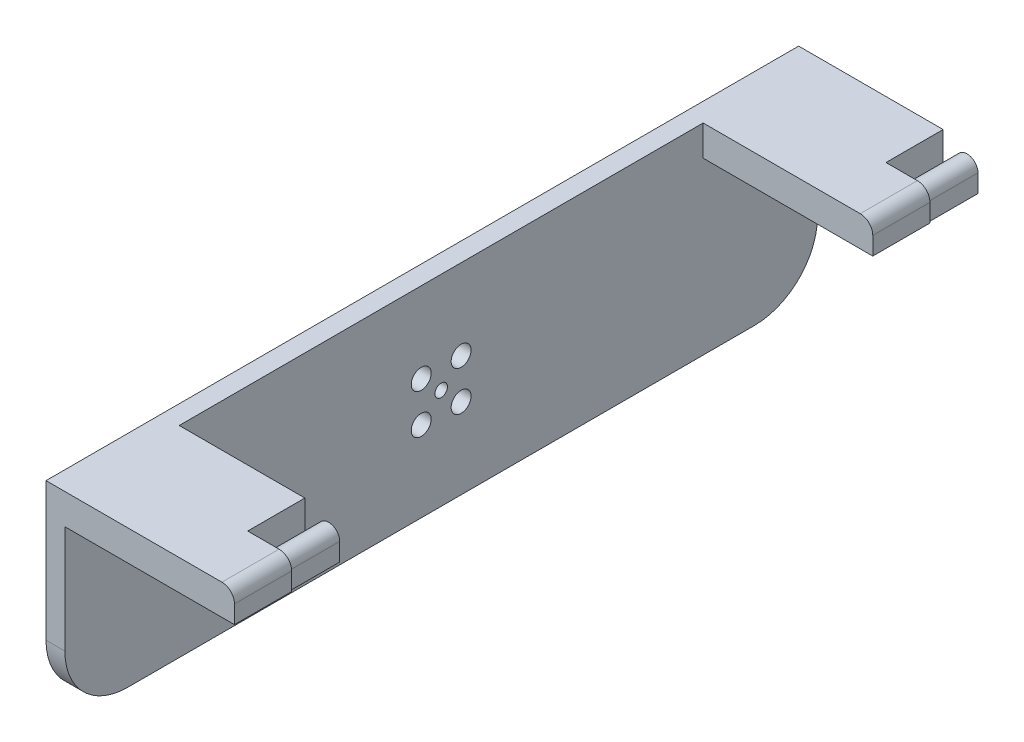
ISO-10303-21;
HEADER;
FILE_DESCRIPTION(('STEP AP214'),'2;1');
FILE_NAME('part.step','',(''),(''),'','','');
FILE_SCHEMA(('AUTOMOTIVE_DESIGN { 1 0 10303 214 1 1 1 1 }'));
ENDSEC;
DATA;
#1=APPLICATION_CONTEXT('core data for automotive mechanical design processes');
#2=APPLICATION_PROTOCOL_DEFINITION('international standard','automotive_design',2000,#1);
#3=PRODUCT_CONTEXT('',#1,'mechanical');
#4=PRODUCT('Part','Part','',(#3));
#5=PRODUCT_RELATED_PRODUCT_CATEGORY('part','',(#4));
#6=PRODUCT_DEFINITION_FORMATION('','',#4);
#7=PRODUCT_DEFINITION_CONTEXT('part definition',#1,'design');
#8=PRODUCT_DEFINITION('design','',#6,#7);
#9=PRODUCT_DEFINITION_SHAPE('','',#8);
#10=(LENGTH_UNIT() NAMED_UNIT(*) SI_UNIT(.MILLI.,.METRE.));
#11=(NAMED_UNIT(*) PLANE_ANGLE_UNIT() SI_UNIT($,.RADIAN.));
#12=(NAMED_UNIT(*) SI_UNIT($,.STERADIAN.) SOLID_ANGLE_UNIT());
#13=UNCERTAINTY_MEASURE_WITH_UNIT(LENGTH_MEASURE(1.E-05),#10,'distance_accuracy_value','');
#14=(GEOMETRIC_REPRESENTATION_CONTEXT(3) GLOBAL_UNCERTAINTY_ASSIGNED_CONTEXT((#13)) GLOBAL_UNIT_ASSIGNED_CONTEXT((#10,
#11,#12)) REPRESENTATION_CONTEXT('',''));
#15=CARTESIAN_POINT('',(0.,0.,0.));
#16=DIRECTION('',(0.,0.,1.));
#17=DIRECTION('',(1.,0.,0.));
#18=AXIS2_PLACEMENT_3D('',#15,#16,#17);
#19=CARTESIAN_POINT('',(0.,0.,-93.7));
#20=DIRECTION('',(0.,0.,1.));
#21=DIRECTION('',(1.,0.,0.));
#22=AXIS2_PLACEMENT_3D('',#19,#20,#21);
#23=PLANE('',#22);
#24=DIRECTION('',(0.,-1.,0.));
#25=VECTOR('',#24,1.);
#26=CARTESIAN_POINT('',(1.75,0.,-93.7));
#27=LINE('',#26,#25);
#28=CARTESIAN_POINT('',(1.75,0.,-93.7));
#29=VERTEX_POINT('',#28);
#30=CARTESIAN_POINT('',(1.75,-2.85,-93.7));
#31=VERTEX_POINT('',#30);
#32=EDGE_CURVE('E224',#29,#31,#27,.T.);
#33=ORIENTED_EDGE('',*,*,#32,.F.);
#34=CARTESIAN_POINT('',(0.,0.,-93.7));
#35=DIRECTION('',(0.,0.,-1.));
#36=DIRECTION('',(-1.,0.,0.));
#37=AXIS2_PLACEMENT_3D('',#34,#35,#36);
#38=CIRCLE('',#37,1.75);
#39=CARTESIAN_POINT('',(-1.75,0.,-93.7));
#40=VERTEX_POINT('',#39);
#41=EDGE_CURVE('E223',#40,#29,#38,.T.);
#42=ORIENTED_EDGE('',*,*,#41,.F.);
#43=DIRECTION('',(0.,1.,0.));
#44=VECTOR('',#43,1.);
#45=CARTESIAN_POINT('',(-1.75,-2.85,-93.7));
#46=LINE('',#45,#44);
#47=CARTESIAN_POINT('',(-1.75,-2.85,-93.7));
#48=VERTEX_POINT('',#47);
#49=EDGE_CURVE('E209',#48,#40,#46,.T.);
#50=ORIENTED_EDGE('',*,*,#49,.F.);
#51=DIRECTION('',(1.,0.,0.));
#52=VECTOR('',#51,1.);
#53=CARTESIAN_POINT('',(2.,-2.85,-93.7));
#54=LINE('',#53,#52);
#55=CARTESIAN_POINT('',(-5.,-2.85,-93.7));
#56=VERTEX_POINT('',#55);
#57=EDGE_CURVE('E222',#56,#48,#54,.T.);
#58=ORIENTED_EDGE('',*,*,#57,.F.);
#59=DIRECTION('',(0.,-1.,0.));
#60=VECTOR('',#59,1.);
#61=CARTESIAN_POINT('',(-5.,-2.85,-93.7));
#62=LINE('',#61,#60);
#63=CARTESIAN_POINT('',(-5.,2.,-93.7));
#64=VERTEX_POINT('',#63);
#65=EDGE_CURVE('E646',#64,#56,#62,.T.);
#66=ORIENTED_EDGE('',*,*,#65,.F.);
#67=DIRECTION('',(-1.,0.,0.));
#68=VECTOR('',#67,1.);
#69=CARTESIAN_POINT('',(0.,2.,-93.7));
#70=LINE('',#69,#68);
#71=CARTESIAN_POINT('',(0.,2.,-93.7));
#72=VERTEX_POINT('',#71);
#73=EDGE_CURVE('E236',#72,#64,#70,.T.);
#74=ORIENTED_EDGE('',*,*,#73,.F.);
#75=CARTESIAN_POINT('',(0.,0.,-93.7));
#76=DIRECTION('',(0.,0.,1.));
#77=DIRECTION('',(1.,0.,0.));
#78=AXIS2_PLACEMENT_3D('',#75,#76,#77);
#79=CIRCLE('',#78,2.);
#80=CARTESIAN_POINT('',(2.,0.,-93.7));
#81=VERTEX_POINT('',#80);
#82=EDGE_CURVE('E653',#81,#72,#79,.T.);
#83=ORIENTED_EDGE('',*,*,#82,.F.);
#84=DIRECTION('',(0.,1.,0.));
#85=VECTOR('',#84,1.);
#86=CARTESIAN_POINT('',(2.,0.,-93.7));
#87=LINE('',#86,#85);
#88=CARTESIAN_POINT('',(2.,-2.85,-93.7));
#89=VERTEX_POINT('',#88);
#90=EDGE_CURVE('E231',#89,#81,#87,.T.);
#91=ORIENTED_EDGE('',*,*,#90,.F.);
#92=EDGE_CURVE('E232',#31,#89,#54,.T.);
#93=ORIENTED_EDGE('',*,*,#92,.F.);
#94=EDGE_LOOP('',(#33,#42,#50,#58,#66,#74,#83,#91,#93));
#95=FACE_BOUND('',#94,.T.);
#96=ADVANCED_FACE('F29',(#95),#23,.F.);
#97=CARTESIAN_POINT('',(-25.,-30.,-102.8));
#98=DIRECTION('',(-1.,0.,0.));
#99=DIRECTION('',(0.,0.,1.));
#100=AXIS2_PLACEMENT_3D('',#97,#98,#99);
#101=PLANE('',#100);
#102=CARTESIAN_POINT('',(-25.,-17.175,-46.075));
#103=DIRECTION('',(1.,0.,0.));
#104=DIRECTION('',(0.,0.,1.));
#105=AXIS2_PLACEMENT_3D('',#102,#103,#104);
#106=CIRCLE('',#105,1.5875);
#107=CARTESIAN_POINT('',(-25.,-17.175,-44.4875));
#108=VERTEX_POINT('',#107);
#109=EDGE_CURVE('E602',#108,#108,#106,.T.);
#110=ORIENTED_EDGE('',*,*,#109,.F.);
#111=EDGE_LOOP('',(#110));
#112=FACE_BOUND('',#111,.T.);
#113=CARTESIAN_POINT('',(-25.,-17.175,-39.725));
#114=DIRECTION('',(1.,0.,0.));
#115=DIRECTION('',(0.,0.,-1.));
#116=AXIS2_PLACEMENT_3D('',#113,#114,#115);
#117=CIRCLE('',#116,1.58750000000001);
#118=CARTESIAN_POINT('',(-25.,-17.175,-41.3125));
#119=VERTEX_POINT('',#118);
#120=EDGE_CURVE('E604',#119,#119,#117,.T.);
#121=ORIENTED_EDGE('',*,*,#120,.F.);
#122=EDGE_LOOP('',(#121));
#123=FACE_BOUND('',#122,.T.);
#124=CARTESIAN_POINT('',(-25.,-10.825,-39.725));
#125=DIRECTION('',(1.,0.,0.));
#126=DIRECTION('',(0.,0.,1.));
#127=AXIS2_PLACEMENT_3D('',#124,#125,#126);
#128=CIRCLE('',#127,1.58750000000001);
#129=CARTESIAN_POINT('',(-25.,-10.825,-38.1375));
#130=VERTEX_POINT('',#129);
#131=EDGE_CURVE('E612',#130,#130,#128,.T.);
#132=ORIENTED_EDGE('',*,*,#131,.F.);
#133=EDGE_LOOP('',(#132));
#134=FACE_BOUND('',#133,.T.);
#135=CARTESIAN_POINT('',(-25.,-10.825,-46.075));
#136=DIRECTION('',(1.,0.,0.));
#137=DIRECTION('',(0.,0.,-1.));
#138=AXIS2_PLACEMENT_3D('',#135,#136,#137);
#139=CIRCLE('',#138,1.5875);
#140=CARTESIAN_POINT('',(-25.,-10.825,-47.6625));
#141=VERTEX_POINT('',#140);
#142=EDGE_CURVE('E618',#141,#141,#139,.T.);
#143=ORIENTED_EDGE('',*,*,#142,.F.);
#144=EDGE_LOOP('',(#143));
#145=FACE_BOUND('',#144,.T.);
#146=CARTESIAN_POINT('',(-25.,-14.,-42.9));
#147=DIRECTION('',(-1.,0.,0.));
#148=DIRECTION('',(0.,0.,1.));
#149=AXIS2_PLACEMENT_3D('',#146,#147,#148);
#150=CIRCLE('',#149,0.999999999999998);
#151=CARTESIAN_POINT('',(-25.,-14.,-41.9));
#152=VERTEX_POINT('',#151);
#153=EDGE_CURVE('E263',#152,#152,#150,.T.);
#154=ORIENTED_EDGE('',*,*,#153,.T.);
#155=EDGE_LOOP('',(#154));
#156=FACE_BOUND('',#155,.T.);
#157=DIRECTION('',(0.,0.,1.));
#158=VECTOR('',#157,1.);
#159=CARTESIAN_POINT('',(-25.,-30.,-102.8));
#160=LINE('',#159,#158);
#161=CARTESIAN_POINT('',(-25.,-30.,-92.8));
#162=VERTEX_POINT('',#161);
#163=CARTESIAN_POINT('',(-25.,-30.,7.00000000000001));
#164=VERTEX_POINT('',#163);
#165=EDGE_CURVE('E271',#162,#164,#160,.T.);
#166=ORIENTED_EDGE('',*,*,#165,.F.);
#167=CARTESIAN_POINT('',(-25.,-20.,-92.8));
#168=DIRECTION('',(-1.,0.,0.));
#169=DIRECTION('',(0.,0.,1.));
#170=AXIS2_PLACEMENT_3D('',#167,#168,#169);
#171=CIRCLE('',#170,10.);
#172=CARTESIAN_POINT('',(-25.,-20.,-102.8));
#173=VERTEX_POINT('',#172);
#174=EDGE_CURVE('E287',#162,#173,#171,.F.);
#175=ORIENTED_EDGE('',*,*,#174,.T.);
#176=DIRECTION('',(0.,-1.,0.));
#177=VECTOR('',#176,1.);
#178=CARTESIAN_POINT('',(-25.,2.,-102.8));
#179=LINE('',#178,#177);
#180=CARTESIAN_POINT('',(-25.,-2.85,-102.8));
#181=VERTEX_POINT('',#180);
#182=EDGE_CURVE('E269',#181,#173,#179,.T.);
#183=ORIENTED_EDGE('',*,*,#182,.F.);
#184=DIRECTION('',(0.,0.,-1.));
#185=VECTOR('',#184,1.);
#186=CARTESIAN_POINT('',(-25.,-2.85,-84.6));
#187=LINE('',#186,#185);
#188=CARTESIAN_POINT('',(-25.,-2.85000000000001,-84.6));
#189=VERTEX_POINT('',#188);
#190=EDGE_CURVE('E258',#189,#181,#187,.T.);
#191=ORIENTED_EDGE('',*,*,#190,.F.);
#192=DIRECTION('',(0.,-1.,0.));
#193=VECTOR('',#192,1.);
#194=CARTESIAN_POINT('',(-25.,2.,-84.6));
#195=LINE('',#194,#193);
#196=CARTESIAN_POINT('',(-25.,2.,-84.6));
#197=VERTEX_POINT('',#196);
#198=EDGE_CURVE('E245',#197,#189,#195,.T.);
#199=ORIENTED_EDGE('',*,*,#198,.F.);
#200=DIRECTION('',(0.,0.,-1.));
#201=VECTOR('',#200,1.);
#202=CARTESIAN_POINT('',(-25.,2.,-102.8));
#203=LINE('',#202,#201);
#204=CARTESIAN_POINT('',(-25.,2.,-1.20000000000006));
#205=VERTEX_POINT('',#204);
#206=EDGE_CURVE('E282',#205,#197,#203,.T.);
#207=ORIENTED_EDGE('',*,*,#206,.F.);
#208=DIRECTION('',(0.,1.,0.));
#209=VECTOR('',#208,1.);
#210=CARTESIAN_POINT('',(-25.,-2.85,-1.2));
#211=LINE('',#210,#209);
#212=CARTESIAN_POINT('',(-25.,-2.85,-1.2));
#213=VERTEX_POINT('',#212);
#214=EDGE_CURVE('E312',#213,#205,#211,.T.);
#215=ORIENTED_EDGE('',*,*,#214,.F.);
#216=DIRECTION('',(0.,0.,-1.));
#217=VECTOR('',#216,1.);
#218=CARTESIAN_POINT('',(-25.,-2.85,17.));
#219=LINE('',#218,#217);
#220=CARTESIAN_POINT('',(-25.,-2.85,17.));
#221=VERTEX_POINT('',#220);
#222=EDGE_CURVE('E355',#221,#213,#219,.T.);
#223=ORIENTED_EDGE('',*,*,#222,.F.);
#224=DIRECTION('',(0.,1.,0.));
#225=VECTOR('',#224,1.);
#226=CARTESIAN_POINT('',(-25.,2.,17.));
#227=LINE('',#226,#225);
#228=CARTESIAN_POINT('',(-25.,-20.,17.));
#229=VERTEX_POINT('',#228);
#230=EDGE_CURVE('E274',#229,#221,#227,.T.);
#231=ORIENTED_EDGE('',*,*,#230,.F.);
#232=CARTESIAN_POINT('',(-25.,-20.,7.));
#233=DIRECTION('',(-1.,0.,0.));
#234=DIRECTION('',(0.,0.,1.));
#235=AXIS2_PLACEMENT_3D('',#232,#233,#234);
#236=CIRCLE('',#235,10.);
#237=EDGE_CURVE('E285',#229,#164,#236,.F.);
#238=ORIENTED_EDGE('',*,*,#237,.T.);
#239=EDGE_LOOP('',(#166,#175,#183,#191,#199,#207,#215,#223,#231,#238));
#240=FACE_BOUND('',#239,.T.);
#241=ADVANCED_FACE('F390',(#112,#123,#134,#145,#156,#240),#101,.F.);
#242=CARTESIAN_POINT('',(0.,0.,7.9));
#243=DIRECTION('',(0.,0.,1.));
#244=DIRECTION('',(1.,0.,0.));
#245=AXIS2_PLACEMENT_3D('',#242,#243,#244);
#246=PLANE('',#245);
#247=DIRECTION('',(0.,-1.,0.));
#248=VECTOR('',#247,1.);
#249=CARTESIAN_POINT('',(-5.,-2.85000000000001,7.9));
#250=LINE('',#249,#248);
#251=CARTESIAN_POINT('',(-5.,2.,7.9));
#252=VERTEX_POINT('',#251);
#253=CARTESIAN_POINT('',(-5.,-2.85000000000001,7.9));
#254=VERTEX_POINT('',#253);
#255=EDGE_CURVE('E317',#252,#254,#250,.T.);
#256=ORIENTED_EDGE('',*,*,#255,.F.);
#257=DIRECTION('',(-1.,0.,0.));
#258=VECTOR('',#257,1.);
#259=CARTESIAN_POINT('',(0.,2.,7.9));
#260=LINE('',#259,#258);
#261=CARTESIAN_POINT('',(0.,2.,7.9));
#262=VERTEX_POINT('',#261);
#263=EDGE_CURVE('E337',#262,#252,#260,.T.);
#264=ORIENTED_EDGE('',*,*,#263,.F.);
#265=CARTESIAN_POINT('',(0.,0.,7.9));
#266=DIRECTION('',(0.,0.,1.));
#267=DIRECTION('',(1.,0.,0.));
#268=AXIS2_PLACEMENT_3D('',#265,#266,#267);
#269=CIRCLE('',#268,2.);
#270=CARTESIAN_POINT('',(2.,0.,7.9));
#271=VERTEX_POINT('',#270);
#272=EDGE_CURVE('E334',#271,#262,#269,.T.);
#273=ORIENTED_EDGE('',*,*,#272,.F.);
#274=DIRECTION('',(0.,1.,0.));
#275=VECTOR('',#274,1.);
#276=CARTESIAN_POINT('',(2.,0.,7.9));
#277=LINE('',#276,#275);
#278=CARTESIAN_POINT('',(2.,-2.85,7.9));
#279=VERTEX_POINT('',#278);
#280=EDGE_CURVE('E343',#279,#271,#277,.T.);
#281=ORIENTED_EDGE('',*,*,#280,.F.);
#282=DIRECTION('',(1.,0.,0.));
#283=VECTOR('',#282,1.);
#284=CARTESIAN_POINT('',(2.,-2.85,7.9));
#285=LINE('',#284,#283);
#286=CARTESIAN_POINT('',(1.75,-2.85,7.9));
#287=VERTEX_POINT('',#286);
#288=EDGE_CURVE('E340',#287,#279,#285,.T.);
#289=ORIENTED_EDGE('',*,*,#288,.F.);
#290=DIRECTION('',(0.,1.,0.));
#291=VECTOR('',#290,1.);
#292=CARTESIAN_POINT('',(1.75,0.,7.9));
#293=LINE('',#292,#291);
#294=CARTESIAN_POINT('',(1.75,0.,7.9));
#295=VERTEX_POINT('',#294);
#296=EDGE_CURVE('E696',#287,#295,#293,.T.);
#297=ORIENTED_EDGE('',*,*,#296,.T.);
#298=CARTESIAN_POINT('',(0.,0.,7.9));
#299=DIRECTION('',(0.,0.,1.));
#300=DIRECTION('',(1.,0.,0.));
#301=AXIS2_PLACEMENT_3D('',#298,#299,#300);
#302=CIRCLE('',#301,1.75);
#303=CARTESIAN_POINT('',(-1.75,0.,7.9));
#304=VERTEX_POINT('',#303);
#305=EDGE_CURVE('E686',#295,#304,#302,.T.);
#306=ORIENTED_EDGE('',*,*,#305,.T.);
#307=DIRECTION('',(0.,-1.,0.));
#308=VECTOR('',#307,1.);
#309=CARTESIAN_POINT('',(-1.75,0.,7.9));
#310=LINE('',#309,#308);
#311=CARTESIAN_POINT('',(-1.75,-2.85,7.9));
#312=VERTEX_POINT('',#311);
#313=EDGE_CURVE('E689',#304,#312,#310,.T.);
#314=ORIENTED_EDGE('',*,*,#313,.T.);
#315=EDGE_CURVE('E350',#254,#312,#285,.T.);
#316=ORIENTED_EDGE('',*,*,#315,.F.);
#317=EDGE_LOOP('',(#256,#264,#273,#281,#289,#297,#306,#314,#316));
#318=FACE_BOUND('',#317,.T.);
#319=ADVANCED_FACE('F432',(#318),#246,.F.);
#320=CARTESIAN_POINT('',(0.,0.,7.9));
#321=DIRECTION('',(0.,0.,-1.));
#322=DIRECTION('',(-1.,0.,0.));
#323=AXIS2_PLACEMENT_3D('',#320,#321,#322);
#324=CYLINDRICAL_SURFACE('',#323,1.75);
#325=CARTESIAN_POINT('',(0.,0.,0.));
#326=DIRECTION('',(0.,0.,1.));
#327=DIRECTION('',(1.,0.,0.));
#328=AXIS2_PLACEMENT_3D('',#325,#326,#327);
#329=CIRCLE('',#328,1.75);
#330=CARTESIAN_POINT('',(1.75,0.,0.));
#331=VERTEX_POINT('',#330);
#332=CARTESIAN_POINT('',(-1.75,0.,0.));
#333=VERTEX_POINT('',#332);
#334=EDGE_CURVE('E675',#331,#333,#329,.T.);
#335=ORIENTED_EDGE('',*,*,#334,.T.);
#336=DIRECTION('',(0.,0.,-1.));
#337=VECTOR('',#336,1.);
#338=CARTESIAN_POINT('',(-1.75,0.,7.9));
#339=LINE('',#338,#337);
#340=EDGE_CURVE('E307',#304,#333,#339,.T.);
#341=ORIENTED_EDGE('',*,*,#340,.F.);
#342=ORIENTED_EDGE('',*,*,#305,.F.);
#343=DIRECTION('',(0.,0.,-1.));
#344=VECTOR('',#343,1.);
#345=CARTESIAN_POINT('',(1.75,0.,7.9));
#346=LINE('',#345,#344);
#347=EDGE_CURVE('E692',#295,#331,#346,.T.);
#348=ORIENTED_EDGE('',*,*,#347,.T.);
#349=EDGE_LOOP('',(#335,#341,#342,#348));
#350=FACE_BOUND('',#349,.T.);
#351=ADVANCED_FACE('F31',(#350),#324,.T.);
#352=CARTESIAN_POINT('',(-1.75,0.,7.9));
#353=DIRECTION('',(1.,0.,0.));
#354=DIRECTION('',(0.,1.,0.));
#355=AXIS2_PLACEMENT_3D('',#352,#353,#354);
#356=PLANE('',#355);
#357=DIRECTION('',(0.,-1.,0.));
#358=VECTOR('',#357,1.);
#359=CARTESIAN_POINT('',(-1.75,0.,0.));
#360=LINE('',#359,#358);
#361=CARTESIAN_POINT('',(-1.75,-2.85,0.));
#362=VERTEX_POINT('',#361);
#363=EDGE_CURVE('E680',#333,#362,#360,.T.);
#364=ORIENTED_EDGE('',*,*,#363,.T.);
#365=DIRECTION('',(0.,0.,-1.));
#366=VECTOR('',#365,1.);
#367=CARTESIAN_POINT('',(-1.75,-2.85,7.9));
#368=LINE('',#367,#366);
#369=EDGE_CURVE('E309',#312,#362,#368,.T.);
#370=ORIENTED_EDGE('',*,*,#369,.F.);
#371=ORIENTED_EDGE('',*,*,#313,.F.);
#372=ORIENTED_EDGE('',*,*,#340,.T.);
#373=EDGE_LOOP('',(#364,#370,#371,#372));
#374=FACE_BOUND('',#373,.T.);
#375=ADVANCED_FACE('F721',(#374),#356,.F.);
#376=CARTESIAN_POINT('',(-1.75,-2.85,7.9));
#377=DIRECTION('',(0.,1.,0.));
#378=DIRECTION('',(0.,0.,1.));
#379=AXIS2_PLACEMENT_3D('',#376,#377,#378);
#380=PLANE('',#379);
#381=CARTESIAN_POINT('',(0.,-2.85,6.4));
#382=DIRECTION('',(0.,-1.,0.));
#383=DIRECTION('',(0.,0.,-1.));
#384=AXIS2_PLACEMENT_3D('',#381,#382,#383);
#385=CIRCLE('',#384,0.59563);
#386=CARTESIAN_POINT('',(0.,-2.85,5.80437));
#387=VERTEX_POINT('',#386);
#388=EDGE_CURVE('E669',#387,#387,#385,.T.);
#389=ORIENTED_EDGE('',*,*,#388,.F.);
#390=EDGE_LOOP('',(#389));
#391=FACE_BOUND('',#390,.T.);
#392=DIRECTION('',(1.,0.,0.));
#393=VECTOR('',#392,1.);
#394=CARTESIAN_POINT('',(-1.75,-2.85,0.));
#395=LINE('',#394,#393);
#396=CARTESIAN_POINT('',(1.75,-2.85,0.));
#397=VERTEX_POINT('',#396);
#398=EDGE_CURVE('E682',#362,#397,#395,.T.);
#399=ORIENTED_EDGE('',*,*,#398,.T.);
#400=DIRECTION('',(0.,0.,-1.));
#401=VECTOR('',#400,1.);
#402=CARTESIAN_POINT('',(1.75,-2.85,7.9));
#403=LINE('',#402,#401);
#404=EDGE_CURVE('E700',#287,#397,#403,.T.);
#405=ORIENTED_EDGE('',*,*,#404,.F.);
#406=ORIENTED_EDGE('',*,*,#288,.T.);
#407=DIRECTION('',(0.,0.,-1.));
#408=VECTOR('',#407,1.);
#409=CARTESIAN_POINT('',(2.,-2.85,17.));
#410=LINE('',#409,#408);
#411=CARTESIAN_POINT('',(2.,-2.85,17.));
#412=VERTEX_POINT('',#411);
#413=EDGE_CURVE('E359',#412,#279,#410,.T.);
#414=ORIENTED_EDGE('',*,*,#413,.F.);
#415=DIRECTION('',(1.,0.,0.));
#416=VECTOR('',#415,1.);
#417=CARTESIAN_POINT('',(2.,-2.85,17.));
#418=LINE('',#417,#416);
#419=EDGE_CURVE('E362',#221,#412,#418,.T.);
#420=ORIENTED_EDGE('',*,*,#419,.F.);
#421=ORIENTED_EDGE('',*,*,#222,.T.);
#422=DIRECTION('',(-1.,0.,0.));
#423=VECTOR('',#422,1.);
#424=CARTESIAN_POINT('',(-25.,-2.85,-1.2));
#425=LINE('',#424,#423);
#426=CARTESIAN_POINT('',(-5.,-2.85000000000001,-1.2));
#427=VERTEX_POINT('',#426);
#428=EDGE_CURVE('E326',#427,#213,#425,.T.);
#429=ORIENTED_EDGE('',*,*,#428,.F.);
#430=DIRECTION('',(0.,0.,1.));
#431=VECTOR('',#430,1.);
#432=CARTESIAN_POINT('',(-5.,-2.85000000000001,-1.2));
#433=LINE('',#432,#431);
#434=EDGE_CURVE('E329',#427,#254,#433,.T.);
#435=ORIENTED_EDGE('',*,*,#434,.T.);
#436=ORIENTED_EDGE('',*,*,#315,.T.);
#437=ORIENTED_EDGE('',*,*,#369,.T.);
#438=EDGE_LOOP('',(#399,#405,#406,#414,#420,#421,#429,#435,#436,#437));
#439=FACE_BOUND('',#438,.T.);
#440=ADVANCED_FACE('F384',(#391,#439),#380,.F.);
#441=CARTESIAN_POINT('',(1.75,0.,7.9));
#442=DIRECTION('',(-1.,0.,0.));
#443=DIRECTION('',(0.,-1.,0.));
#444=AXIS2_PLACEMENT_3D('',#441,#442,#443);
#445=PLANE('',#444);
#446=DIRECTION('',(0.,1.,0.));
#447=VECTOR('',#446,1.);
#448=CARTESIAN_POINT('',(1.75,0.,0.));
#449=LINE('',#448,#447);
#450=EDGE_CURVE('E684',#397,#331,#449,.T.);
#451=ORIENTED_EDGE('',*,*,#450,.T.);
#452=ORIENTED_EDGE('',*,*,#347,.F.);
#453=ORIENTED_EDGE('',*,*,#296,.F.);
#454=ORIENTED_EDGE('',*,*,#404,.T.);
#455=EDGE_LOOP('',(#451,#452,#453,#454));
#456=FACE_BOUND('',#455,.T.);
#457=ADVANCED_FACE('F714',(#456),#445,.F.);
#458=CARTESIAN_POINT('',(0.,0.,0.));
#459=DIRECTION('',(0.,0.,1.));
#460=DIRECTION('',(1.,0.,0.));
#461=AXIS2_PLACEMENT_3D('',#458,#459,#460);
#462=PLANE('',#461);
#463=ORIENTED_EDGE('',*,*,#334,.F.);
#464=ORIENTED_EDGE('',*,*,#450,.F.);
#465=ORIENTED_EDGE('',*,*,#398,.F.);
#466=ORIENTED_EDGE('',*,*,#363,.F.);
#467=EDGE_LOOP('',(#463,#464,#465,#466));
#468=FACE_BOUND('',#467,.T.);
#469=ADVANCED_FACE('F719',(#468),#462,.F.);
#470=CARTESIAN_POINT('',(0.,0.65,6.4));
#471=DIRECTION('',(0.,-1.,0.));
#472=DIRECTION('',(0.,0.,-1.));
#473=AXIS2_PLACEMENT_3D('',#470,#471,#472);
#474=CYLINDRICAL_SURFACE('',#473,0.59563);
#475=CARTESIAN_POINT('',(0.,0.65,6.4));
#476=DIRECTION('',(0.,-1.,0.));
#477=DIRECTION('',(0.,0.,-1.));
#478=AXIS2_PLACEMENT_3D('',#475,#476,#477);
#479=CIRCLE('',#478,0.59563);
#480=CARTESIAN_POINT('',(0.,0.65,5.80437));
#481=VERTEX_POINT('',#480);
#482=EDGE_CURVE('E671',#481,#481,#479,.T.);
#483=ORIENTED_EDGE('',*,*,#482,.F.);
#484=EDGE_LOOP('',(#483));
#485=FACE_BOUND('',#484,.T.);
#486=ORIENTED_EDGE('',*,*,#388,.T.);
#487=EDGE_LOOP('',(#486));
#488=FACE_BOUND('',#487,.T.);
#489=ADVANCED_FACE('F732',(#485,#488),#474,.F.);
#490=CARTESIAN_POINT('',(0.,0.65,6.4));
#491=DIRECTION('',(0.,-1.,0.));
#492=DIRECTION('',(0.,0.,-1.));
#493=AXIS2_PLACEMENT_3D('',#490,#491,#492);
#494=PLANE('',#493);
#495=ORIENTED_EDGE('',*,*,#482,.T.);
#496=EDGE_LOOP('',(#495));
#497=FACE_BOUND('',#496,.T.);
#498=ADVANCED_FACE('F725',(#497),#494,.T.);
#499=CARTESIAN_POINT('',(0.,0.,17.));
#500=DIRECTION('',(0.,0.,-1.));
#501=DIRECTION('',(-1.,0.,0.));
#502=AXIS2_PLACEMENT_3D('',#499,#500,#501);
#503=CYLINDRICAL_SURFACE('',#502,2.);
#504=ORIENTED_EDGE('',*,*,#272,.T.);
#505=DIRECTION('',(0.,0.,-1.));
#506=VECTOR('',#505,1.);
#507=CARTESIAN_POINT('',(0.,2.,17.));
#508=LINE('',#507,#506);
#509=CARTESIAN_POINT('',(0.,2.,17.));
#510=VERTEX_POINT('',#509);
#511=EDGE_CURVE('E358',#510,#262,#508,.T.);
#512=ORIENTED_EDGE('',*,*,#511,.F.);
#513=CARTESIAN_POINT('',(0.,0.,17.));
#514=DIRECTION('',(0.,0.,1.));
#515=DIRECTION('',(1.,0.,0.));
#516=AXIS2_PLACEMENT_3D('',#513,#514,#515);
#517=CIRCLE('',#516,2.);
#518=CARTESIAN_POINT('',(2.,0.,17.));
#519=VERTEX_POINT('',#518);
#520=EDGE_CURVE('E404',#519,#510,#517,.T.);
#521=ORIENTED_EDGE('',*,*,#520,.F.);
#522=DIRECTION('',(0.,0.,-1.));
#523=VECTOR('',#522,1.);
#524=CARTESIAN_POINT('',(2.,0.,17.));
#525=LINE('',#524,#523);
#526=EDGE_CURVE('E664',#519,#271,#525,.T.);
#527=ORIENTED_EDGE('',*,*,#526,.T.);
#528=EDGE_LOOP('',(#504,#512,#521,#527));
#529=FACE_BOUND('',#528,.T.);
#530=ADVANCED_FACE('F474',(#529),#503,.T.);
#531=CARTESIAN_POINT('',(0.,2.,17.));
#532=DIRECTION('',(0.,-1.,0.));
#533=DIRECTION('',(1.,0.,0.));
#534=AXIS2_PLACEMENT_3D('',#531,#532,#533);
#535=PLANE('',#534);
#536=DIRECTION('',(0.,0.,1.));
#537=VECTOR('',#536,1.);
#538=CARTESIAN_POINT('',(-5.,2.,-102.8));
#539=LINE('',#538,#537);
#540=CARTESIAN_POINT('',(-5.,2.,-102.8));
#541=VERTEX_POINT('',#540);
#542=EDGE_CURVE('E408',#541,#64,#539,.T.);
#543=ORIENTED_EDGE('',*,*,#542,.F.);
#544=DIRECTION('',(1.,0.,0.));
#545=VECTOR('',#544,1.);
#546=CARTESIAN_POINT('',(-28.,2.,-102.8));
#547=LINE('',#546,#545);
#548=CARTESIAN_POINT('',(-28.,2.,-102.8));
#549=VERTEX_POINT('',#548);
#550=EDGE_CURVE('E392',#549,#541,#547,.T.);
#551=ORIENTED_EDGE('',*,*,#550,.F.);
#552=DIRECTION('',(0.,0.,-1.));
#553=VECTOR('',#552,1.);
#554=CARTESIAN_POINT('',(-28.,2.,-102.8));
#555=LINE('',#554,#553);
#556=CARTESIAN_POINT('',(-28.,2.,17.));
#557=VERTEX_POINT('',#556);
#558=EDGE_CURVE('E394',#557,#549,#555,.T.);
#559=ORIENTED_EDGE('',*,*,#558,.F.);
#560=DIRECTION('',(-1.,0.,0.));
#561=VECTOR('',#560,1.);
#562=CARTESIAN_POINT('',(0.,2.,17.));
#563=LINE('',#562,#561);
#564=EDGE_CURVE('E365',#510,#557,#563,.T.);
#565=ORIENTED_EDGE('',*,*,#564,.F.);
#566=ORIENTED_EDGE('',*,*,#511,.T.);
#567=ORIENTED_EDGE('',*,*,#263,.T.);
#568=DIRECTION('',(0.,0.,1.));
#569=VECTOR('',#568,1.);
#570=CARTESIAN_POINT('',(-5.,2.,-1.2));
#571=LINE('',#570,#569);
#572=CARTESIAN_POINT('',(-5.,2.,-1.2));
#573=VERTEX_POINT('',#572);
#574=EDGE_CURVE('E332',#573,#252,#571,.T.);
#575=ORIENTED_EDGE('',*,*,#574,.F.);
#576=DIRECTION('',(1.,0.,0.));
#577=VECTOR('',#576,1.);
#578=CARTESIAN_POINT('',(-25.,2.,-1.2));
#579=LINE('',#578,#577);
#580=EDGE_CURVE('E316',#205,#573,#579,.T.);
#581=ORIENTED_EDGE('',*,*,#580,.F.);
#582=ORIENTED_EDGE('',*,*,#206,.T.);
#583=DIRECTION('',(-1.,0.,0.));
#584=VECTOR('',#583,1.);
#585=CARTESIAN_POINT('',(0.,2.,-84.6));
#586=LINE('',#585,#584);
#587=CARTESIAN_POINT('',(0.,2.,-84.6));
#588=VERTEX_POINT('',#587);
#589=EDGE_CURVE('E242',#588,#197,#586,.T.);
#590=ORIENTED_EDGE('',*,*,#589,.F.);
#591=DIRECTION('',(0.,0.,-1.));
#592=VECTOR('',#591,1.);
#593=CARTESIAN_POINT('',(0.,2.,-84.6));
#594=LINE('',#593,#592);
#595=EDGE_CURVE('E260',#588,#72,#594,.T.);
#596=ORIENTED_EDGE('',*,*,#595,.T.);
#597=ORIENTED_EDGE('',*,*,#73,.T.);
#598=EDGE_LOOP('',(#543,#551,#559,#565,#566,#567,#575,#581,#582,#590,#596,#597));
#599=FACE_BOUND('',#598,.T.);
#600=ADVANCED_FACE('F376',(#599),#535,.F.);
#601=CARTESIAN_POINT('',(2.,0.,17.));
#602=DIRECTION('',(-1.,0.,0.));
#603=DIRECTION('',(0.,-1.,0.));
#604=AXIS2_PLACEMENT_3D('',#601,#602,#603);
#605=PLANE('',#604);
#606=ORIENTED_EDGE('',*,*,#280,.T.);
#607=ORIENTED_EDGE('',*,*,#526,.F.);
#608=DIRECTION('',(0.,1.,0.));
#609=VECTOR('',#608,1.);
#610=CARTESIAN_POINT('',(2.,0.,17.));
#611=LINE('',#610,#609);
#612=EDGE_CURVE('E364',#412,#519,#611,.T.);
#613=ORIENTED_EDGE('',*,*,#612,.F.);
#614=ORIENTED_EDGE('',*,*,#413,.T.);
#615=EDGE_LOOP('',(#606,#607,#613,#614));
#616=FACE_BOUND('',#615,.T.);
#617=ADVANCED_FACE('F473',(#616),#605,.F.);
#618=CARTESIAN_POINT('',(0.,0.,17.));
#619=DIRECTION('',(0.,0.,1.));
#620=DIRECTION('',(1.,0.,0.));
#621=AXIS2_PLACEMENT_3D('',#618,#619,#620);
#622=PLANE('',#621);
#623=DIRECTION('',(0.,1.,0.));
#624=VECTOR('',#623,1.);
#625=CARTESIAN_POINT('',(-28.,2.,17.));
#626=LINE('',#625,#624);
#627=CARTESIAN_POINT('',(-28.,-20.,17.));
#628=VERTEX_POINT('',#627);
#629=EDGE_CURVE('E304',#628,#557,#626,.T.);
#630=ORIENTED_EDGE('',*,*,#629,.F.);
#631=DIRECTION('',(1.,0.,0.));
#632=VECTOR('',#631,1.);
#633=CARTESIAN_POINT('',(-25.,-20.,17.));
#634=LINE('',#633,#632);
#635=EDGE_CURVE('E11',#628,#229,#634,.T.);
#636=ORIENTED_EDGE('',*,*,#635,.T.);
#637=ORIENTED_EDGE('',*,*,#230,.T.);
#638=ORIENTED_EDGE('',*,*,#419,.T.);
#639=ORIENTED_EDGE('',*,*,#612,.T.);
#640=ORIENTED_EDGE('',*,*,#520,.T.);
#641=ORIENTED_EDGE('',*,*,#564,.T.);
#642=EDGE_LOOP('',(#630,#636,#637,#638,#639,#640,#641));
#643=FACE_BOUND('',#642,.T.);
#644=ADVANCED_FACE('F402',(#643),#622,.T.);
#645=CARTESIAN_POINT('',(-5.,-2.85000000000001,-1.2));
#646=DIRECTION('',(-1.,0.,0.));
#647=DIRECTION('',(0.,0.,1.));
#648=AXIS2_PLACEMENT_3D('',#645,#646,#647);
#649=PLANE('',#648);
#650=ORIENTED_EDGE('',*,*,#255,.T.);
#651=ORIENTED_EDGE('',*,*,#434,.F.);
#652=DIRECTION('',(0.,-1.,0.));
#653=VECTOR('',#652,1.);
#654=CARTESIAN_POINT('',(-5.,-2.85000000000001,-1.2));
#655=LINE('',#654,#653);
#656=EDGE_CURVE('E324',#573,#427,#655,.T.);
#657=ORIENTED_EDGE('',*,*,#656,.F.);
#658=ORIENTED_EDGE('',*,*,#574,.T.);
#659=EDGE_LOOP('',(#650,#651,#657,#658));
#660=FACE_BOUND('',#659,.T.);
#661=ADVANCED_FACE('F380',(#660),#649,.F.);
#662=CARTESIAN_POINT('',(-25.,2.,-1.2));
#663=DIRECTION('',(0.,0.,-1.));
#664=DIRECTION('',(-1.,0.,0.));
#665=AXIS2_PLACEMENT_3D('',#662,#663,#664);
#666=PLANE('',#665);
#667=ORIENTED_EDGE('',*,*,#214,.T.);
#668=ORIENTED_EDGE('',*,*,#580,.T.);
#669=ORIENTED_EDGE('',*,*,#656,.T.);
#670=ORIENTED_EDGE('',*,*,#428,.T.);
#671=EDGE_LOOP('',(#667,#668,#669,#670));
#672=FACE_BOUND('',#671,.T.);
#673=ADVANCED_FACE('F370',(#672),#666,.T.);
#674=CARTESIAN_POINT('',(-28.,-30.,-102.8));
#675=DIRECTION('',(-1.,0.,0.));
#676=DIRECTION('',(0.,0.,1.));
#677=AXIS2_PLACEMENT_3D('',#674,#675,#676);
#678=PLANE('',#677);
#679=CARTESIAN_POINT('',(-28.,-17.175,-46.075));
#680=DIRECTION('',(1.,0.,0.));
#681=DIRECTION('',(0.,0.,1.));
#682=AXIS2_PLACEMENT_3D('',#679,#680,#681);
#683=CIRCLE('',#682,1.5875);
#684=CARTESIAN_POINT('',(-28.,-17.175,-44.4875));
#685=VERTEX_POINT('',#684);
#686=EDGE_CURVE('E599',#685,#685,#683,.T.);
#687=ORIENTED_EDGE('',*,*,#686,.T.);
#688=EDGE_LOOP('',(#687));
#689=FACE_BOUND('',#688,.T.);
#690=CARTESIAN_POINT('',(-28.,-17.175,-39.725));
#691=DIRECTION('',(1.,0.,0.));
#692=DIRECTION('',(0.,0.,-1.));
#693=AXIS2_PLACEMENT_3D('',#690,#691,#692);
#694=CIRCLE('',#693,1.58750000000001);
#695=CARTESIAN_POINT('',(-28.,-17.175,-41.3125));
#696=VERTEX_POINT('',#695);
#697=EDGE_CURVE('E609',#696,#696,#694,.T.);
#698=ORIENTED_EDGE('',*,*,#697,.T.);
#699=EDGE_LOOP('',(#698));
#700=FACE_BOUND('',#699,.T.);
#701=CARTESIAN_POINT('',(-28.,-10.825,-39.725));
#702=DIRECTION('',(1.,0.,0.));
#703=DIRECTION('',(0.,0.,1.));
#704=AXIS2_PLACEMENT_3D('',#701,#702,#703);
#705=CIRCLE('',#704,1.58750000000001);
#706=CARTESIAN_POINT('',(-28.,-10.825,-38.1375));
#707=VERTEX_POINT('',#706);
#708=EDGE_CURVE('E615',#707,#707,#705,.T.);
#709=ORIENTED_EDGE('',*,*,#708,.T.);
#710=EDGE_LOOP('',(#709));
#711=FACE_BOUND('',#710,.T.);
#712=CARTESIAN_POINT('',(-28.,-10.825,-46.075));
#713=DIRECTION('',(1.,0.,0.));
#714=DIRECTION('',(0.,0.,-1.));
#715=AXIS2_PLACEMENT_3D('',#712,#713,#714);
#716=CIRCLE('',#715,1.5875);
#717=CARTESIAN_POINT('',(-28.,-10.825,-47.6625));
#718=VERTEX_POINT('',#717);
#719=EDGE_CURVE('E621',#718,#718,#716,.T.);
#720=ORIENTED_EDGE('',*,*,#719,.T.);
#721=EDGE_LOOP('',(#720));
#722=FACE_BOUND('',#721,.T.);
#723=DIRECTION('',(0.,-1.,0.));
#724=VECTOR('',#723,1.);
#725=CARTESIAN_POINT('',(-28.,2.,-102.8));
#726=LINE('',#725,#724);
#727=CARTESIAN_POINT('',(-28.,-20.,-102.8));
#728=VERTEX_POINT('',#727);
#729=EDGE_CURVE('E295',#549,#728,#726,.T.);
#730=ORIENTED_EDGE('',*,*,#729,.T.);
#731=CARTESIAN_POINT('',(-28.,-20.,-92.8));
#732=DIRECTION('',(-1.,0.,0.));
#733=DIRECTION('',(0.,0.,1.));
#734=AXIS2_PLACEMENT_3D('',#731,#732,#733);
#735=CIRCLE('',#734,10.);
#736=CARTESIAN_POINT('',(-28.,-30.,-92.8));
#737=VERTEX_POINT('',#736);
#738=EDGE_CURVE('E37',#728,#737,#735,.T.);
#739=ORIENTED_EDGE('',*,*,#738,.T.);
#740=DIRECTION('',(0.,0.,1.));
#741=VECTOR('',#740,1.);
#742=CARTESIAN_POINT('',(-28.,-30.,-102.8));
#743=LINE('',#742,#741);
#744=CARTESIAN_POINT('',(-28.,-30.,7.00000000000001));
#745=VERTEX_POINT('',#744);
#746=EDGE_CURVE('E294',#737,#745,#743,.T.);
#747=ORIENTED_EDGE('',*,*,#746,.T.);
#748=CARTESIAN_POINT('',(-28.,-20.,7.));
#749=DIRECTION('',(-1.,0.,0.));
#750=DIRECTION('',(0.,0.,1.));
#751=AXIS2_PLACEMENT_3D('',#748,#749,#750);
#752=CIRCLE('',#751,10.);
#753=EDGE_CURVE('E44',#745,#628,#752,.T.);
#754=ORIENTED_EDGE('',*,*,#753,.T.);
#755=ORIENTED_EDGE('',*,*,#629,.T.);
#756=ORIENTED_EDGE('',*,*,#558,.T.);
#757=EDGE_LOOP('',(#730,#739,#747,#754,#755,#756));
#758=FACE_BOUND('',#757,.T.);
#759=CARTESIAN_POINT('',(-28.,-14.,-42.9));
#760=DIRECTION('',(-1.,0.,0.));
#761=DIRECTION('',(0.,0.,1.));
#762=AXIS2_PLACEMENT_3D('',#759,#760,#761);
#763=CIRCLE('',#762,0.999999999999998);
#764=CARTESIAN_POINT('',(-28.,-14.,-41.9));
#765=VERTEX_POINT('',#764);
#766=EDGE_CURVE('E266',#765,#765,#763,.T.);
#767=ORIENTED_EDGE('',*,*,#766,.F.);
#768=EDGE_LOOP('',(#767));
#769=FACE_BOUND('',#768,.T.);
#770=ADVANCED_FACE('F292',(#689,#700,#711,#722,#758,#769),#678,.T.);
#771=CARTESIAN_POINT('',(-28.,2.,-102.8));
#772=DIRECTION('',(0.,0.,1.));
#773=DIRECTION('',(1.,0.,0.));
#774=AXIS2_PLACEMENT_3D('',#771,#772,#773);
#775=PLANE('',#774);
#776=ORIENTED_EDGE('',*,*,#182,.T.);
#777=DIRECTION('',(1.,0.,0.));
#778=VECTOR('',#777,1.);
#779=CARTESIAN_POINT('',(-28.,-20.,-102.8));
#780=LINE('',#779,#778);
#781=EDGE_CURVE('E52',#173,#728,#780,.F.);
#782=ORIENTED_EDGE('',*,*,#781,.T.);
#783=ORIENTED_EDGE('',*,*,#729,.F.);
#784=ORIENTED_EDGE('',*,*,#550,.T.);
#785=DIRECTION('',(0.,-1.,0.));
#786=VECTOR('',#785,1.);
#787=CARTESIAN_POINT('',(-5.,-2.85,-102.8));
#788=LINE('',#787,#786);
#789=CARTESIAN_POINT('',(-5.,-2.85,-102.8));
#790=VERTEX_POINT('',#789);
#791=EDGE_CURVE('E648',#541,#790,#788,.T.);
#792=ORIENTED_EDGE('',*,*,#791,.T.);
#793=DIRECTION('',(-1.,0.,0.));
#794=VECTOR('',#793,1.);
#795=CARTESIAN_POINT('',(-25.,-2.85,-102.8));
#796=LINE('',#795,#794);
#797=EDGE_CURVE('E650',#790,#181,#796,.T.);
#798=ORIENTED_EDGE('',*,*,#797,.T.);
#799=EDGE_LOOP('',(#776,#782,#783,#784,#792,#798));
#800=FACE_BOUND('',#799,.T.);
#801=ADVANCED_FACE('F410',(#800),#775,.F.);
#802=CARTESIAN_POINT('',(-28.,-30.,-102.8));
#803=DIRECTION('',(0.,1.,0.));
#804=DIRECTION('',(0.,0.,1.));
#805=AXIS2_PLACEMENT_3D('',#802,#803,#804);
#806=PLANE('',#805);
#807=ORIENTED_EDGE('',*,*,#746,.F.);
#808=DIRECTION('',(1.,0.,0.));
#809=VECTOR('',#808,1.);
#810=CARTESIAN_POINT('',(-28.,-30.,-92.8));
#811=LINE('',#810,#809);
#812=EDGE_CURVE('E283',#737,#162,#811,.T.);
#813=ORIENTED_EDGE('',*,*,#812,.T.);
#814=ORIENTED_EDGE('',*,*,#165,.T.);
#815=DIRECTION('',(1.,0.,0.));
#816=VECTOR('',#815,1.);
#817=CARTESIAN_POINT('',(-28.,-30.,7.));
#818=LINE('',#817,#816);
#819=EDGE_CURVE('E303',#164,#745,#818,.F.);
#820=ORIENTED_EDGE('',*,*,#819,.T.);
#821=EDGE_LOOP('',(#807,#813,#814,#820));
#822=FACE_BOUND('',#821,.T.);
#823=ADVANCED_FACE('F300',(#822),#806,.F.);
#824=CARTESIAN_POINT('',(-28.,-14.,-42.9));
#825=DIRECTION('',(1.,0.,0.));
#826=DIRECTION('',(0.,0.,-1.));
#827=AXIS2_PLACEMENT_3D('',#824,#825,#826);
#828=CYLINDRICAL_SURFACE('',#827,0.999999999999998);
#829=ORIENTED_EDGE('',*,*,#766,.T.);
#830=EDGE_LOOP('',(#829));
#831=FACE_BOUND('',#830,.T.);
#832=ORIENTED_EDGE('',*,*,#153,.F.);
#833=EDGE_LOOP('',(#832));
#834=FACE_BOUND('',#833,.T.);
#835=ADVANCED_FACE('F419',(#831,#834),#828,.F.);
#836=CARTESIAN_POINT('',(0.,0.,-84.6));
#837=DIRECTION('',(0.,0.,-1.));
#838=DIRECTION('',(-1.,0.,0.));
#839=AXIS2_PLACEMENT_3D('',#836,#837,#838);
#840=CYLINDRICAL_SURFACE('',#839,2.);
#841=ORIENTED_EDGE('',*,*,#82,.T.);
#842=ORIENTED_EDGE('',*,*,#595,.F.);
#843=CARTESIAN_POINT('',(0.,0.,-84.6));
#844=DIRECTION('',(0.,0.,1.));
#845=DIRECTION('',(1.,0.,0.));
#846=AXIS2_PLACEMENT_3D('',#843,#844,#845);
#847=CIRCLE('',#846,2.);
#848=CARTESIAN_POINT('',(2.,0.,-84.6));
#849=VERTEX_POINT('',#848);
#850=EDGE_CURVE('E234',#849,#588,#847,.T.);
#851=ORIENTED_EDGE('',*,*,#850,.F.);
#852=DIRECTION('',(0.,0.,-1.));
#853=VECTOR('',#852,1.);
#854=CARTESIAN_POINT('',(2.,0.,-84.6));
#855=LINE('',#854,#853);
#856=EDGE_CURVE('E252',#849,#81,#855,.T.);
#857=ORIENTED_EDGE('',*,*,#856,.T.);
#858=EDGE_LOOP('',(#841,#842,#851,#857));
#859=FACE_BOUND('',#858,.T.);
#860=ADVANCED_FACE('F449',(#859),#840,.T.);
#861=CARTESIAN_POINT('',(2.,-2.85,-84.6));
#862=DIRECTION('',(0.,1.,0.));
#863=DIRECTION('',(-1.,0.,0.));
#864=AXIS2_PLACEMENT_3D('',#861,#862,#863);
#865=PLANE('',#864);
#866=CARTESIAN_POINT('',(0.,-2.85,-95.2));
#867=DIRECTION('',(0.,-1.,0.));
#868=DIRECTION('',(0.,0.,-1.));
#869=AXIS2_PLACEMENT_3D('',#866,#867,#868);
#870=CIRCLE('',#869,0.595630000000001);
#871=CARTESIAN_POINT('',(0.,-2.85,-95.79563));
#872=VERTEX_POINT('',#871);
#873=EDGE_CURVE('E624',#872,#872,#870,.T.);
#874=ORIENTED_EDGE('',*,*,#873,.F.);
#875=EDGE_LOOP('',(#874));
#876=FACE_BOUND('',#875,.T.);
#877=ORIENTED_EDGE('',*,*,#190,.T.);
#878=ORIENTED_EDGE('',*,*,#797,.F.);
#879=DIRECTION('',(0.,0.,1.));
#880=VECTOR('',#879,1.);
#881=CARTESIAN_POINT('',(-5.,-2.85,-102.8));
#882=LINE('',#881,#880);
#883=EDGE_CURVE('E229',#790,#56,#882,.T.);
#884=ORIENTED_EDGE('',*,*,#883,.T.);
#885=ORIENTED_EDGE('',*,*,#57,.T.);
#886=DIRECTION('',(0.,0.,1.));
#887=VECTOR('',#886,1.);
#888=CARTESIAN_POINT('',(-1.75,-2.85,-101.6));
#889=LINE('',#888,#887);
#890=CARTESIAN_POINT('',(-1.75,-2.85,-101.6));
#891=VERTEX_POINT('',#890);
#892=EDGE_CURVE('E205',#891,#48,#889,.T.);
#893=ORIENTED_EDGE('',*,*,#892,.F.);
#894=DIRECTION('',(-1.,0.,0.));
#895=VECTOR('',#894,1.);
#896=CARTESIAN_POINT('',(1.75,-2.85,-101.6));
#897=LINE('',#896,#895);
#898=CARTESIAN_POINT('',(1.75,-2.85,-101.6));
#899=VERTEX_POINT('',#898);
#900=EDGE_CURVE('E635',#899,#891,#897,.T.);
#901=ORIENTED_EDGE('',*,*,#900,.F.);
#902=DIRECTION('',(0.,0.,1.));
#903=VECTOR('',#902,1.);
#904=CARTESIAN_POINT('',(1.75,-2.85,-101.6));
#905=LINE('',#904,#903);
#906=EDGE_CURVE('E214',#899,#31,#905,.T.);
#907=ORIENTED_EDGE('',*,*,#906,.T.);
#908=ORIENTED_EDGE('',*,*,#92,.T.);
#909=DIRECTION('',(0.,0.,-1.));
#910=VECTOR('',#909,1.);
#911=CARTESIAN_POINT('',(2.,-2.85,-84.6));
#912=LINE('',#911,#910);
#913=CARTESIAN_POINT('',(2.,-2.85,-84.6));
#914=VERTEX_POINT('',#913);
#915=EDGE_CURVE('E255',#914,#89,#912,.T.);
#916=ORIENTED_EDGE('',*,*,#915,.F.);
#917=DIRECTION('',(1.,0.,0.));
#918=VECTOR('',#917,1.);
#919=CARTESIAN_POINT('',(2.,-2.85,-84.6));
#920=LINE('',#919,#918);
#921=EDGE_CURVE('E248',#189,#914,#920,.T.);
#922=ORIENTED_EDGE('',*,*,#921,.F.);
#923=EDGE_LOOP('',(#877,#878,#884,#885,#893,#901,#907,#908,#916,#922));
#924=FACE_BOUND('',#923,.T.);
#925=ADVANCED_FACE('F226',(#876,#924),#865,.F.);
#926=CARTESIAN_POINT('',(2.,0.,-84.6));
#927=DIRECTION('',(-1.,0.,0.));
#928=DIRECTION('',(0.,-1.,0.));
#929=AXIS2_PLACEMENT_3D('',#926,#927,#928);
#930=PLANE('',#929);
#931=ORIENTED_EDGE('',*,*,#90,.T.);
#932=ORIENTED_EDGE('',*,*,#856,.F.);
#933=DIRECTION('',(0.,1.,0.));
#934=VECTOR('',#933,1.);
#935=CARTESIAN_POINT('',(2.,0.,-84.6));
#936=LINE('',#935,#934);
#937=EDGE_CURVE('E250',#914,#849,#936,.T.);
#938=ORIENTED_EDGE('',*,*,#937,.F.);
#939=ORIENTED_EDGE('',*,*,#915,.T.);
#940=EDGE_LOOP('',(#931,#932,#938,#939));
#941=FACE_BOUND('',#940,.T.);
#942=ADVANCED_FACE('F442',(#941),#930,.F.);
#943=CARTESIAN_POINT('',(0.,0.,-84.6));
#944=DIRECTION('',(0.,0.,1.));
#945=DIRECTION('',(1.,0.,0.));
#946=AXIS2_PLACEMENT_3D('',#943,#944,#945);
#947=PLANE('',#946);
#948=ORIENTED_EDGE('',*,*,#850,.T.);
#949=ORIENTED_EDGE('',*,*,#589,.T.);
#950=ORIENTED_EDGE('',*,*,#198,.T.);
#951=ORIENTED_EDGE('',*,*,#921,.T.);
#952=ORIENTED_EDGE('',*,*,#937,.T.);
#953=EDGE_LOOP('',(#948,#949,#950,#951,#952));
#954=FACE_BOUND('',#953,.T.);
#955=ADVANCED_FACE('F439',(#954),#947,.T.);
#956=CARTESIAN_POINT('',(-5.,-2.85,-102.8));
#957=DIRECTION('',(-1.,0.,0.));
#958=DIRECTION('',(0.,0.,1.));
#959=AXIS2_PLACEMENT_3D('',#956,#957,#958);
#960=PLANE('',#959);
#961=ORIENTED_EDGE('',*,*,#65,.T.);
#962=ORIENTED_EDGE('',*,*,#883,.F.);
#963=ORIENTED_EDGE('',*,*,#791,.F.);
#964=ORIENTED_EDGE('',*,*,#542,.T.);
#965=EDGE_LOOP('',(#961,#962,#963,#964));
#966=FACE_BOUND('',#965,.T.);
#967=ADVANCED_FACE('F437',(#966),#960,.F.);
#968=CARTESIAN_POINT('',(1.75,0.,-101.6));
#969=DIRECTION('',(-1.,0.,0.));
#970=DIRECTION('',(0.,-1.,0.));
#971=AXIS2_PLACEMENT_3D('',#968,#969,#970);
#972=PLANE('',#971);
#973=ORIENTED_EDGE('',*,*,#32,.T.);
#974=ORIENTED_EDGE('',*,*,#906,.F.);
#975=DIRECTION('',(0.,-1.,0.));
#976=VECTOR('',#975,1.);
#977=CARTESIAN_POINT('',(1.75,0.,-101.6));
#978=LINE('',#977,#976);
#979=CARTESIAN_POINT('',(1.75,0.,-101.6));
#980=VERTEX_POINT('',#979);
#981=EDGE_CURVE('E632',#980,#899,#978,.T.);
#982=ORIENTED_EDGE('',*,*,#981,.F.);
#983=DIRECTION('',(0.,0.,1.));
#984=VECTOR('',#983,1.);
#985=CARTESIAN_POINT('',(1.75,0.,-101.6));
#986=LINE('',#985,#984);
#987=EDGE_CURVE('E640',#980,#29,#986,.T.);
#988=ORIENTED_EDGE('',*,*,#987,.T.);
#989=EDGE_LOOP('',(#973,#974,#982,#988));
#990=FACE_BOUND('',#989,.T.);
#991=ADVANCED_FACE('F494',(#990),#972,.F.);
#992=CARTESIAN_POINT('',(-1.75,-2.85,-101.6));
#993=DIRECTION('',(1.,0.,0.));
#994=DIRECTION('',(0.,1.,0.));
#995=AXIS2_PLACEMENT_3D('',#992,#993,#994);
#996=PLANE('',#995);
#997=ORIENTED_EDGE('',*,*,#49,.T.);
#998=DIRECTION('',(0.,0.,1.));
#999=VECTOR('',#998,1.);
#1000=CARTESIAN_POINT('',(-1.75,0.,-101.6));
#1001=LINE('',#1000,#999);
#1002=CARTESIAN_POINT('',(-1.75,0.,-101.6));
#1003=VERTEX_POINT('',#1002);
#1004=EDGE_CURVE('E215',#1003,#40,#1001,.T.);
#1005=ORIENTED_EDGE('',*,*,#1004,.F.);
#1006=DIRECTION('',(0.,1.,0.));
#1007=VECTOR('',#1006,1.);
#1008=CARTESIAN_POINT('',(-1.75,-2.85,-101.6));
#1009=LINE('',#1008,#1007);
#1010=EDGE_CURVE('E211',#891,#1003,#1009,.T.);
#1011=ORIENTED_EDGE('',*,*,#1010,.F.);
#1012=ORIENTED_EDGE('',*,*,#892,.T.);
#1013=EDGE_LOOP('',(#997,#1005,#1011,#1012));
#1014=FACE_BOUND('',#1013,.T.);
#1015=ADVANCED_FACE('F207',(#1014),#996,.F.);
#1016=CARTESIAN_POINT('',(0.,0.,-101.6));
#1017=DIRECTION('',(0.,0.,1.));
#1018=DIRECTION('',(1.,0.,0.));
#1019=AXIS2_PLACEMENT_3D('',#1016,#1017,#1018);
#1020=CYLINDRICAL_SURFACE('',#1019,1.75);
#1021=ORIENTED_EDGE('',*,*,#41,.T.);
#1022=ORIENTED_EDGE('',*,*,#987,.F.);
#1023=CARTESIAN_POINT('',(0.,0.,-101.6));
#1024=DIRECTION('',(0.,0.,-1.));
#1025=DIRECTION('',(-1.,0.,0.));
#1026=AXIS2_PLACEMENT_3D('',#1023,#1024,#1025);
#1027=CIRCLE('',#1026,1.75);
#1028=EDGE_CURVE('E638',#1003,#980,#1027,.T.);
#1029=ORIENTED_EDGE('',*,*,#1028,.F.);
#1030=ORIENTED_EDGE('',*,*,#1004,.T.);
#1031=EDGE_LOOP('',(#1021,#1022,#1029,#1030));
#1032=FACE_BOUND('',#1031,.T.);
#1033=ADVANCED_FACE('F519',(#1032),#1020,.T.);
#1034=CARTESIAN_POINT('',(0.,0.,-101.6));
#1035=DIRECTION('',(0.,0.,-1.));
#1036=DIRECTION('',(-1.,0.,0.));
#1037=AXIS2_PLACEMENT_3D('',#1034,#1035,#1036);
#1038=PLANE('',#1037);
#1039=ORIENTED_EDGE('',*,*,#981,.T.);
#1040=ORIENTED_EDGE('',*,*,#900,.T.);
#1041=ORIENTED_EDGE('',*,*,#1010,.T.);
#1042=ORIENTED_EDGE('',*,*,#1028,.T.);
#1043=EDGE_LOOP('',(#1039,#1040,#1041,#1042));
#1044=FACE_BOUND('',#1043,.T.);
#1045=ADVANCED_FACE('F526',(#1044),#1038,.T.);
#1046=CARTESIAN_POINT('',(0.,0.15,-95.2));
#1047=DIRECTION('',(0.,-1.,0.));
#1048=DIRECTION('',(0.,0.,-1.));
#1049=AXIS2_PLACEMENT_3D('',#1046,#1047,#1048);
#1050=CYLINDRICAL_SURFACE('',#1049,0.595630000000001);
#1051=CARTESIAN_POINT('',(0.,0.15,-95.2));
#1052=DIRECTION('',(0.,-1.,0.));
#1053=DIRECTION('',(0.,0.,-1.));
#1054=AXIS2_PLACEMENT_3D('',#1051,#1052,#1053);
#1055=CIRCLE('',#1054,0.595630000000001);
#1056=CARTESIAN_POINT('',(0.,0.15,-95.79563));
#1057=VERTEX_POINT('',#1056);
#1058=EDGE_CURVE('E627',#1057,#1057,#1055,.T.);
#1059=ORIENTED_EDGE('',*,*,#1058,.F.);
#1060=EDGE_LOOP('',(#1059));
#1061=FACE_BOUND('',#1060,.T.);
#1062=ORIENTED_EDGE('',*,*,#873,.T.);
#1063=EDGE_LOOP('',(#1062));
#1064=FACE_BOUND('',#1063,.T.);
#1065=ADVANCED_FACE('F533',(#1061,#1064),#1050,.F.);
#1066=CARTESIAN_POINT('',(0.,0.15,-95.2));
#1067=DIRECTION('',(0.,-1.,0.));
#1068=DIRECTION('',(0.,0.,-1.));
#1069=AXIS2_PLACEMENT_3D('',#1066,#1067,#1068);
#1070=PLANE('',#1069);
#1071=ORIENTED_EDGE('',*,*,#1058,.T.);
#1072=EDGE_LOOP('',(#1071));
#1073=FACE_BOUND('',#1072,.T.);
#1074=ADVANCED_FACE('F540',(#1073),#1070,.T.);
#1075=CARTESIAN_POINT('',(-28.,-20.,-92.8));
#1076=DIRECTION('',(1.,0.,0.));
#1077=DIRECTION('',(0.,0.,-1.));
#1078=AXIS2_PLACEMENT_3D('',#1075,#1076,#1077);
#1079=CYLINDRICAL_SURFACE('',#1078,10.);
#1080=ORIENTED_EDGE('',*,*,#738,.F.);
#1081=ORIENTED_EDGE('',*,*,#781,.F.);
#1082=ORIENTED_EDGE('',*,*,#174,.F.);
#1083=ORIENTED_EDGE('',*,*,#812,.F.);
#1084=EDGE_LOOP('',(#1080,#1081,#1082,#1083));
#1085=FACE_BOUND('',#1084,.T.);
#1086=ADVANCED_FACE('F306',(#1085),#1079,.T.);
#1087=CARTESIAN_POINT('',(0.,-20.,7.));
#1088=DIRECTION('',(-1.,0.,0.));
#1089=DIRECTION('',(0.,0.,1.));
#1090=AXIS2_PLACEMENT_3D('',#1087,#1088,#1089);
#1091=CYLINDRICAL_SURFACE('',#1090,10.);
#1092=ORIENTED_EDGE('',*,*,#753,.F.);
#1093=ORIENTED_EDGE('',*,*,#819,.F.);
#1094=ORIENTED_EDGE('',*,*,#237,.F.);
#1095=ORIENTED_EDGE('',*,*,#635,.F.);
#1096=EDGE_LOOP('',(#1092,#1093,#1094,#1095));
#1097=FACE_BOUND('',#1096,.T.);
#1098=ADVANCED_FACE('F555',(#1097),#1091,.T.);
#1099=CARTESIAN_POINT('',(-28.,-10.825,-46.075));
#1100=DIRECTION('',(1.,0.,0.));
#1101=DIRECTION('',(0.,0.,-1.));
#1102=AXIS2_PLACEMENT_3D('',#1099,#1100,#1101);
#1103=CYLINDRICAL_SURFACE('',#1102,1.5875);
#1104=ORIENTED_EDGE('',*,*,#719,.F.);
#1105=EDGE_LOOP('',(#1104));
#1106=FACE_BOUND('',#1105,.T.);
#1107=ORIENTED_EDGE('',*,*,#142,.T.);
#1108=EDGE_LOOP('',(#1107));
#1109=FACE_BOUND('',#1108,.T.);
#1110=ADVANCED_FACE('F562',(#1106,#1109),#1103,.F.);
#1111=CARTESIAN_POINT('',(-28.,-10.825,-39.725));
#1112=DIRECTION('',(1.,0.,0.));
#1113=DIRECTION('',(0.,0.,-1.));
#1114=AXIS2_PLACEMENT_3D('',#1111,#1112,#1113);
#1115=CYLINDRICAL_SURFACE('',#1114,1.58750000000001);
#1116=ORIENTED_EDGE('',*,*,#708,.F.);
#1117=EDGE_LOOP('',(#1116));
#1118=FACE_BOUND('',#1117,.T.);
#1119=ORIENTED_EDGE('',*,*,#131,.T.);
#1120=EDGE_LOOP('',(#1119));
#1121=FACE_BOUND('',#1120,.T.);
#1122=ADVANCED_FACE('F570',(#1118,#1121),#1115,.F.);
#1123=CARTESIAN_POINT('',(-28.,-17.175,-39.725));
#1124=DIRECTION('',(1.,0.,0.));
#1125=DIRECTION('',(0.,0.,-1.));
#1126=AXIS2_PLACEMENT_3D('',#1123,#1124,#1125);
#1127=CYLINDRICAL_SURFACE('',#1126,1.58750000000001);
#1128=ORIENTED_EDGE('',*,*,#697,.F.);
#1129=EDGE_LOOP('',(#1128));
#1130=FACE_BOUND('',#1129,.T.);
#1131=ORIENTED_EDGE('',*,*,#120,.T.);
#1132=EDGE_LOOP('',(#1131));
#1133=FACE_BOUND('',#1132,.T.);
#1134=ADVANCED_FACE('F578',(#1130,#1133),#1127,.F.);
#1135=CARTESIAN_POINT('',(-28.,-17.175,-46.075));
#1136=DIRECTION('',(1.,0.,0.));
#1137=DIRECTION('',(0.,0.,-1.));
#1138=AXIS2_PLACEMENT_3D('',#1135,#1136,#1137);
#1139=CYLINDRICAL_SURFACE('',#1138,1.5875);
#1140=ORIENTED_EDGE('',*,*,#686,.F.);
#1141=EDGE_LOOP('',(#1140));
#1142=FACE_BOUND('',#1141,.T.);
#1143=ORIENTED_EDGE('',*,*,#109,.T.);
#1144=EDGE_LOOP('',(#1143));
#1145=FACE_BOUND('',#1144,.T.);
#1146=ADVANCED_FACE('F586',(#1142,#1145),#1139,.F.);
#1147=CLOSED_SHELL('',(#96,#241,#319,#351,#375,#440,#457,#469,#489,#498,#530,#600,#617,#644,
#661,#673,#770,#801,#823,#835,#860,#925,#942,#955,#967,#991,#1015,#1033,#1045,#1065,#1074,#1086,
#1098,#1110,#1122,#1134,#1146));
#1148=MANIFOLD_SOLID_BREP('B2',#1147);
#1149=ADVANCED_BREP_SHAPE_REPRESENTATION('',(#18,#1148),#14);
#1150=SHAPE_DEFINITION_REPRESENTATION(#9,#1149);
ENDSEC;
END-ISO-10303-21;
